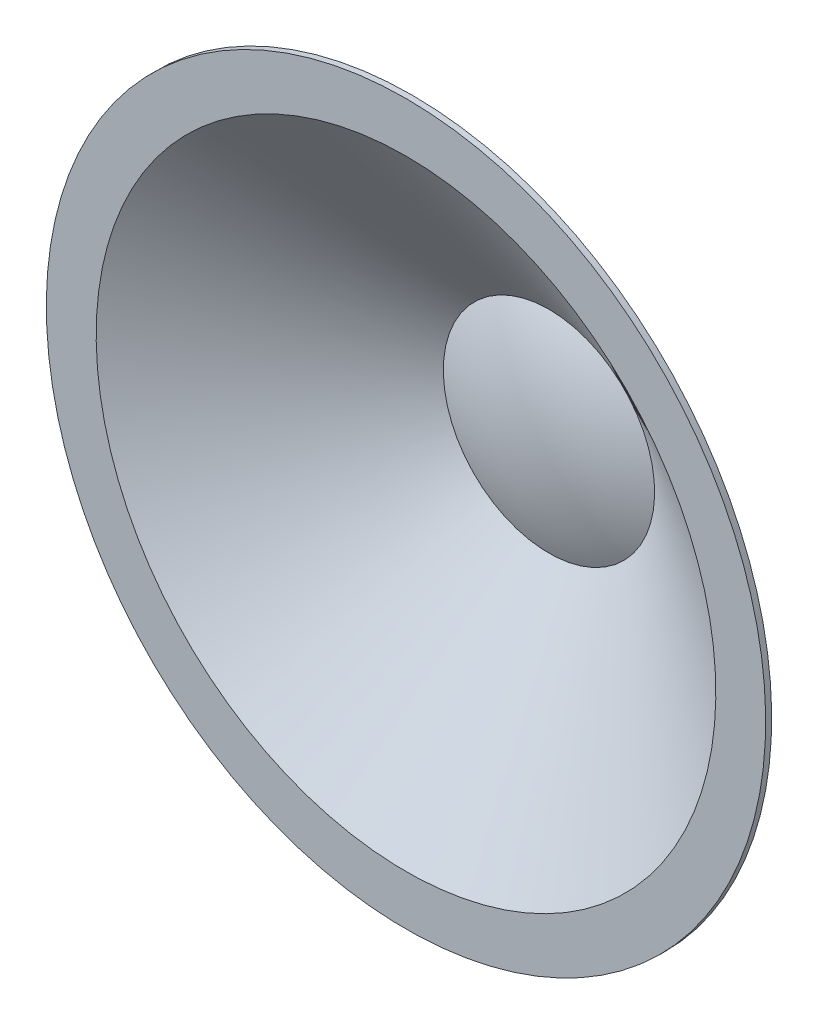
from build123d import *

# Parameters (mm, degrees)
FILLET1_R    = 1
SCALE1_SCALE = 2


with BuildPart() as part:
    # Sketch1 → Revolve-Thin1 (revolve)
    with BuildSketch(Plane(origin=(0, 0, 0), x_dir=(0, 0, -1), z_dir=(1, 0, 0))):
        with BuildLine():
            Line((0, 30), (0, 26))
            Line((0, 26), (12, 8.862223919))
            ThreePointArc((12, 8.862223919), (10.506209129, 4.542549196), (10, 0))
            Line((10, 0), (9.5, 0))
            ThreePointArc((9.5, 0), (9.986787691, 4.509912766), (11.42472682, 8.812075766))
            Line((11.42472682, 8.812075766), (-0.5, 25.842350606))
            Line((-0.5, 25.842350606), (-0.5, 30))
            Line((-0.5, 30), (0, 30))
        make_face()
    revolve(axis=Axis((0, 0, -12), (0, 0, 1)))

    # Fillet1
    fillet1_edges = [part.edges().sort_by_distance(p)[0] for p in [
        (0, -26, 0),
    ]]
    fillet(fillet1_edges, radius=FILLET1_R)


with BuildPart() as part_1:
    # Scale1: scaled about (0, 0, -4.118545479)
    add(part.part.scale(SCALE1_SCALE).moved(Location((0, 0, 4.118545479))))


solid = part_1.part
